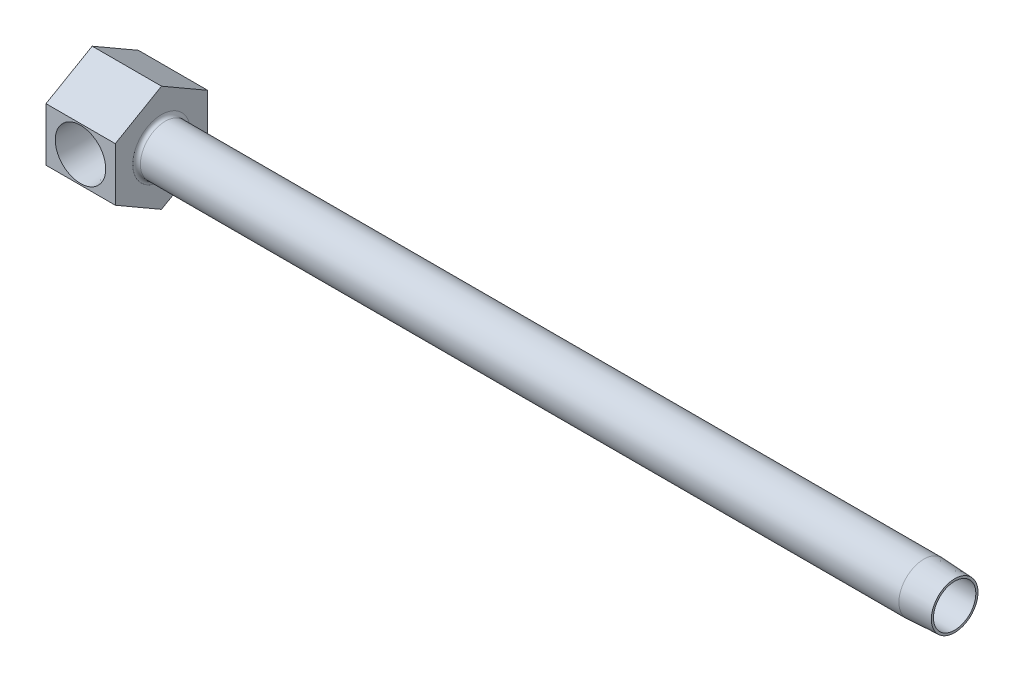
ISO-10303-21;
HEADER;
FILE_DESCRIPTION(('STEP AP214'),'2;1');
FILE_NAME('part.step','',(''),(''),'','','');
FILE_SCHEMA(('AUTOMOTIVE_DESIGN { 1 0 10303 214 1 1 1 1 }'));
ENDSEC;
DATA;
#1=APPLICATION_CONTEXT('core data for automotive mechanical design processes');
#2=APPLICATION_PROTOCOL_DEFINITION('international standard','automotive_design',2000,#1);
#3=PRODUCT_CONTEXT('',#1,'mechanical');
#4=PRODUCT('Part','Part','',(#3));
#5=PRODUCT_RELATED_PRODUCT_CATEGORY('part','',(#4));
#6=PRODUCT_DEFINITION_FORMATION('','',#4);
#7=PRODUCT_DEFINITION_CONTEXT('part definition',#1,'design');
#8=PRODUCT_DEFINITION('design','',#6,#7);
#9=PRODUCT_DEFINITION_SHAPE('','',#8);
#10=(LENGTH_UNIT() NAMED_UNIT(*) SI_UNIT(.MILLI.,.METRE.));
#11=(NAMED_UNIT(*) PLANE_ANGLE_UNIT() SI_UNIT($,.RADIAN.));
#12=(NAMED_UNIT(*) SI_UNIT($,.STERADIAN.) SOLID_ANGLE_UNIT());
#13=UNCERTAINTY_MEASURE_WITH_UNIT(LENGTH_MEASURE(1.E-05),#10,'distance_accuracy_value','');
#14=(GEOMETRIC_REPRESENTATION_CONTEXT(3) GLOBAL_UNCERTAINTY_ASSIGNED_CONTEXT((#13)) GLOBAL_UNIT_ASSIGNED_CONTEXT((#10,
#11,#12)) REPRESENTATION_CONTEXT('',''));
#15=CARTESIAN_POINT('',(0.,0.,0.));
#16=DIRECTION('',(0.,0.,1.));
#17=DIRECTION('',(1.,0.,0.));
#18=AXIS2_PLACEMENT_3D('',#15,#16,#17);
#19=CARTESIAN_POINT('',(7.14375,0.,9.525));
#20=DIRECTION('',(1.,0.,0.));
#21=DIRECTION('',(0.,0.,-1.));
#22=AXIS2_PLACEMENT_3D('',#19,#20,#21);
#23=PLANE('',#22);
#24=DIRECTION('',(0.,0.,1.));
#25=VECTOR('',#24,1.);
#26=CARTESIAN_POINT('',(7.14375,4.21628045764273,19.05));
#27=LINE('',#26,#25);
#28=CARTESIAN_POINT('',(7.14375,4.21628045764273,8.39289543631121));
#29=VERTEX_POINT('',#28);
#30=CARTESIAN_POINT('',(7.14375,4.21628045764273,10.16));
#31=VERTEX_POINT('',#30);
#32=EDGE_CURVE('E280',#29,#31,#27,.T.);
#33=ORIENTED_EDGE('',*,*,#32,.F.);
#34=CARTESIAN_POINT('',(7.14375,0.,9.525));
#35=DIRECTION('',(1.,0.,0.));
#36=DIRECTION('',(0.,0.,-1.));
#37=AXIS2_PLACEMENT_3D('',#34,#35,#36);
#38=CIRCLE('',#37,4.365625);
#39=CARTESIAN_POINT('',(7.14375,4.31919629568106,10.16));
#40=VERTEX_POINT('',#39);
#41=EDGE_CURVE('E163',#29,#40,#38,.T.);
#42=ORIENTED_EDGE('',*,*,#41,.T.);
#43=DIRECTION('',(0.,1.,0.));
#44=VECTOR('',#43,1.);
#45=CARTESIAN_POINT('',(7.14375,0.,10.16));
#46=LINE('',#45,#44);
#47=EDGE_CURVE('E153',#31,#40,#46,.T.);
#48=ORIENTED_EDGE('',*,*,#47,.F.);
#49=EDGE_LOOP('',(#33,#42,#48));
#50=FACE_BOUND('',#49,.T.);
#51=ADVANCED_FACE('F15',(#50),#23,.T.);
#52=CARTESIAN_POINT('',(14.2875,5.4992613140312,19.05));
#53=DIRECTION('',(0.,0.,-1.));
#54=DIRECTION('',(-1.,0.,0.));
#55=AXIS2_PLACEMENT_3D('',#52,#53,#54);
#56=PLANE('',#55);
#57=CARTESIAN_POINT('',(7.112,0.,19.05));
#58=DIRECTION('',(0.,0.,1.));
#59=DIRECTION('',(1.,0.,0.));
#60=AXIS2_PLACEMENT_3D('',#57,#58,#59);
#61=CIRCLE('',#60,5.2023645);
#62=CARTESIAN_POINT('',(12.3143645,0.,19.05));
#63=VERTEX_POINT('',#62);
#64=EDGE_CURVE('E269',#63,#63,#61,.T.);
#65=ORIENTED_EDGE('',*,*,#64,.F.);
#66=EDGE_LOOP('',(#65));
#67=FACE_BOUND('',#66,.T.);
#68=DIRECTION('',(0.,-1.,0.));
#69=VECTOR('',#68,1.);
#70=CARTESIAN_POINT('',(0.,5.4992613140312,19.05));
#71=LINE('',#70,#69);
#72=CARTESIAN_POINT('',(0.,5.4992613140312,19.05));
#73=VERTEX_POINT('',#72);
#74=CARTESIAN_POINT('',(0.,-5.49926131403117,19.05));
#75=VERTEX_POINT('',#74);
#76=EDGE_CURVE('E178',#73,#75,#71,.T.);
#77=ORIENTED_EDGE('',*,*,#76,.T.);
#78=DIRECTION('',(-1.,0.,0.));
#79=VECTOR('',#78,1.);
#80=CARTESIAN_POINT('',(14.2875,-5.49926131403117,19.05));
#81=LINE('',#80,#79);
#82=CARTESIAN_POINT('',(14.2875,-5.49926131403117,19.05));
#83=VERTEX_POINT('',#82);
#84=EDGE_CURVE('E201',#83,#75,#81,.T.);
#85=ORIENTED_EDGE('',*,*,#84,.F.);
#86=DIRECTION('',(0.,-1.,0.));
#87=VECTOR('',#86,1.);
#88=CARTESIAN_POINT('',(14.2875,5.4992613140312,19.05));
#89=LINE('',#88,#87);
#90=CARTESIAN_POINT('',(14.2875,5.4992613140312,19.05));
#91=VERTEX_POINT('',#90);
#92=EDGE_CURVE('E194',#91,#83,#89,.T.);
#93=ORIENTED_EDGE('',*,*,#92,.F.);
#94=DIRECTION('',(-1.,0.,0.));
#95=VECTOR('',#94,1.);
#96=CARTESIAN_POINT('',(14.2875,5.4992613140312,19.05));
#97=LINE('',#96,#95);
#98=EDGE_CURVE('E204',#91,#73,#97,.T.);
#99=ORIENTED_EDGE('',*,*,#98,.T.);
#100=EDGE_LOOP('',(#77,#85,#93,#99));
#101=FACE_BOUND('',#100,.T.);
#102=ADVANCED_FACE('F119',(#67,#101),#56,.F.);
#103=CARTESIAN_POINT('',(14.2875,-5.49926131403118,0.));
#104=DIRECTION('',(1.,0.,0.));
#105=DIRECTION('',(0.,1.,0.));
#106=AXIS2_PLACEMENT_3D('',#103,#104,#105);
#107=PLANE('',#106);
#108=CARTESIAN_POINT('',(14.2875,0.,9.525));
#109=DIRECTION('',(1.,0.,0.));
#110=DIRECTION('',(0.,1.,0.));
#111=AXIS2_PLACEMENT_3D('',#108,#109,#110);
#112=CIRCLE('',#111,5.9309);
#113=CARTESIAN_POINT('',(14.2875,5.9309,9.525));
#114=VERTEX_POINT('',#113);
#115=EDGE_CURVE('E216',#114,#114,#112,.F.);
#116=ORIENTED_EDGE('',*,*,#115,.T.);
#117=EDGE_LOOP('',(#116));
#118=FACE_BOUND('',#117,.T.);
#119=DIRECTION('',(0.,0.5,-0.866025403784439));
#120=VECTOR('',#119,1.);
#121=CARTESIAN_POINT('',(14.2875,-10.9985226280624,9.525));
#122=LINE('',#121,#120);
#123=CARTESIAN_POINT('',(14.2875,-10.9985226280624,9.525));
#124=VERTEX_POINT('',#123);
#125=CARTESIAN_POINT('',(14.2875,-5.49926131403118,0.));
#126=VERTEX_POINT('',#125);
#127=EDGE_CURVE('E184',#124,#126,#122,.T.);
#128=ORIENTED_EDGE('',*,*,#127,.T.);
#129=DIRECTION('',(0.,1.,0.));
#130=VECTOR('',#129,1.);
#131=CARTESIAN_POINT('',(14.2875,-5.49926131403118,0.));
#132=LINE('',#131,#130);
#133=CARTESIAN_POINT('',(14.2875,5.49926131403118,0.));
#134=VERTEX_POINT('',#133);
#135=EDGE_CURVE('E188',#126,#134,#132,.T.);
#136=ORIENTED_EDGE('',*,*,#135,.T.);
#137=DIRECTION('',(0.,0.5,0.866025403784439));
#138=VECTOR('',#137,1.);
#139=CARTESIAN_POINT('',(14.2875,5.49926131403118,0.));
#140=LINE('',#139,#138);
#141=CARTESIAN_POINT('',(14.2875,10.9985226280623,9.525));
#142=VERTEX_POINT('',#141);
#143=EDGE_CURVE('E190',#134,#142,#140,.T.);
#144=ORIENTED_EDGE('',*,*,#143,.T.);
#145=DIRECTION('',(0.,-0.5,0.86602540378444));
#146=VECTOR('',#145,1.);
#147=CARTESIAN_POINT('',(14.2875,10.9985226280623,9.525));
#148=LINE('',#147,#146);
#149=EDGE_CURVE('E192',#142,#91,#148,.T.);
#150=ORIENTED_EDGE('',*,*,#149,.T.);
#151=ORIENTED_EDGE('',*,*,#92,.T.);
#152=DIRECTION('',(0.,-0.5,-0.866025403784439));
#153=VECTOR('',#152,1.);
#154=CARTESIAN_POINT('',(14.2875,-5.49926131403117,19.05));
#155=LINE('',#154,#153);
#156=EDGE_CURVE('E38',#83,#124,#155,.T.);
#157=ORIENTED_EDGE('',*,*,#156,.T.);
#158=EDGE_LOOP('',(#128,#136,#144,#150,#151,#157));
#159=FACE_BOUND('',#158,.T.);
#160=ADVANCED_FACE('F127',(#118,#159),#107,.T.);
#161=CARTESIAN_POINT('',(14.2875,-10.9985226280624,9.525));
#162=DIRECTION('',(0.,0.866025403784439,0.5));
#163=DIRECTION('',(0.,-0.5,0.866025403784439));
#164=AXIS2_PLACEMENT_3D('',#161,#162,#163);
#165=PLANE('',#164);
#166=DIRECTION('',(0.,0.5,-0.866025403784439));
#167=VECTOR('',#166,1.);
#168=CARTESIAN_POINT('',(0.,-10.9985226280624,9.525));
#169=LINE('',#168,#167);
#170=CARTESIAN_POINT('',(0.,-10.9985226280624,9.525));
#171=VERTEX_POINT('',#170);
#172=CARTESIAN_POINT('',(0.,-5.49926131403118,0.));
#173=VERTEX_POINT('',#172);
#174=EDGE_CURVE('E166',#171,#173,#169,.T.);
#175=ORIENTED_EDGE('',*,*,#174,.T.);
#176=DIRECTION('',(-1.,0.,0.));
#177=VECTOR('',#176,1.);
#178=CARTESIAN_POINT('',(14.2875,-5.49926131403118,0.));
#179=LINE('',#178,#177);
#180=EDGE_CURVE('E213',#126,#173,#179,.T.);
#181=ORIENTED_EDGE('',*,*,#180,.F.);
#182=ORIENTED_EDGE('',*,*,#127,.F.);
#183=DIRECTION('',(-1.,0.,0.));
#184=VECTOR('',#183,1.);
#185=CARTESIAN_POINT('',(14.2875,-10.9985226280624,9.525));
#186=LINE('',#185,#184);
#187=EDGE_CURVE('E197',#124,#171,#186,.T.);
#188=ORIENTED_EDGE('',*,*,#187,.T.);
#189=EDGE_LOOP('',(#175,#181,#182,#188));
#190=FACE_BOUND('',#189,.T.);
#191=ADVANCED_FACE('F301',(#190),#165,.F.);
#192=CARTESIAN_POINT('',(14.2875,-5.49926131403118,0.));
#193=DIRECTION('',(0.,0.,1.));
#194=DIRECTION('',(0.,-1.,0.));
#195=AXIS2_PLACEMENT_3D('',#192,#193,#194);
#196=PLANE('',#195);
#197=DIRECTION('',(0.,1.,0.));
#198=VECTOR('',#197,1.);
#199=CARTESIAN_POINT('',(0.,-5.49926131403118,0.));
#200=LINE('',#199,#198);
#201=CARTESIAN_POINT('',(0.,5.49926131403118,0.));
#202=VERTEX_POINT('',#201);
#203=EDGE_CURVE('E169',#173,#202,#200,.T.);
#204=ORIENTED_EDGE('',*,*,#203,.T.);
#205=DIRECTION('',(-1.,0.,0.));
#206=VECTOR('',#205,1.);
#207=CARTESIAN_POINT('',(14.2875,5.49926131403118,0.));
#208=LINE('',#207,#206);
#209=EDGE_CURVE('E210',#134,#202,#208,.T.);
#210=ORIENTED_EDGE('',*,*,#209,.F.);
#211=ORIENTED_EDGE('',*,*,#135,.F.);
#212=ORIENTED_EDGE('',*,*,#180,.T.);
#213=EDGE_LOOP('',(#204,#210,#211,#212));
#214=FACE_BOUND('',#213,.T.);
#215=ADVANCED_FACE('F307',(#214),#196,.F.);
#216=CARTESIAN_POINT('',(14.2875,5.49926131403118,0.));
#217=DIRECTION('',(0.,-0.866025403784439,0.5));
#218=DIRECTION('',(0.,-0.5,-0.866025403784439));
#219=AXIS2_PLACEMENT_3D('',#216,#217,#218);
#220=PLANE('',#219);
#221=DIRECTION('',(0.,0.5,0.866025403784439));
#222=VECTOR('',#221,1.);
#223=CARTESIAN_POINT('',(0.,5.49926131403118,0.));
#224=LINE('',#223,#222);
#225=CARTESIAN_POINT('',(0.,10.9985226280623,9.525));
#226=VERTEX_POINT('',#225);
#227=EDGE_CURVE('E172',#202,#226,#224,.T.);
#228=ORIENTED_EDGE('',*,*,#227,.T.);
#229=DIRECTION('',(-1.,0.,0.));
#230=VECTOR('',#229,1.);
#231=CARTESIAN_POINT('',(14.2875,10.9985226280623,9.525));
#232=LINE('',#231,#230);
#233=EDGE_CURVE('E207',#142,#226,#232,.T.);
#234=ORIENTED_EDGE('',*,*,#233,.F.);
#235=ORIENTED_EDGE('',*,*,#143,.F.);
#236=ORIENTED_EDGE('',*,*,#209,.T.);
#237=EDGE_LOOP('',(#228,#234,#235,#236));
#238=FACE_BOUND('',#237,.T.);
#239=ADVANCED_FACE('F309',(#238),#220,.F.);
#240=CARTESIAN_POINT('',(14.2875,10.9985226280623,9.525));
#241=DIRECTION('',(0.,-0.86602540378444,-0.5));
#242=DIRECTION('',(0.,0.5,-0.86602540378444));
#243=AXIS2_PLACEMENT_3D('',#240,#241,#242);
#244=PLANE('',#243);
#245=DIRECTION('',(0.,-0.5,0.86602540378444));
#246=VECTOR('',#245,1.);
#247=CARTESIAN_POINT('',(0.,10.9985226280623,9.525));
#248=LINE('',#247,#246);
#249=EDGE_CURVE('E175',#226,#73,#248,.T.);
#250=ORIENTED_EDGE('',*,*,#249,.T.);
#251=ORIENTED_EDGE('',*,*,#98,.F.);
#252=ORIENTED_EDGE('',*,*,#149,.F.);
#253=ORIENTED_EDGE('',*,*,#233,.T.);
#254=EDGE_LOOP('',(#250,#251,#252,#253));
#255=FACE_BOUND('',#254,.T.);
#256=ADVANCED_FACE('F312',(#255),#244,.F.);
#257=CARTESIAN_POINT('',(14.2875,-5.49926131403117,19.05));
#258=DIRECTION('',(0.,0.866025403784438,-0.5));
#259=DIRECTION('',(0.,0.5,0.866025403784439));
#260=AXIS2_PLACEMENT_3D('',#257,#258,#259);
#261=PLANE('',#260);
#262=DIRECTION('',(0.,-0.5,-0.866025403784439));
#263=VECTOR('',#262,1.);
#264=CARTESIAN_POINT('',(0.,-5.49926131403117,19.05));
#265=LINE('',#264,#263);
#266=EDGE_CURVE('E181',#75,#171,#265,.T.);
#267=ORIENTED_EDGE('',*,*,#266,.T.);
#268=ORIENTED_EDGE('',*,*,#187,.F.);
#269=ORIENTED_EDGE('',*,*,#156,.F.);
#270=ORIENTED_EDGE('',*,*,#84,.T.);
#271=EDGE_LOOP('',(#267,#268,#269,#270));
#272=FACE_BOUND('',#271,.T.);
#273=ADVANCED_FACE('F296',(#272),#261,.F.);
#274=CARTESIAN_POINT('',(0.,-5.49926131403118,0.));
#275=DIRECTION('',(1.,0.,0.));
#276=DIRECTION('',(0.,1.,0.));
#277=AXIS2_PLACEMENT_3D('',#274,#275,#276);
#278=PLANE('',#277);
#279=ORIENTED_EDGE('',*,*,#174,.F.);
#280=ORIENTED_EDGE('',*,*,#266,.F.);
#281=ORIENTED_EDGE('',*,*,#76,.F.);
#282=ORIENTED_EDGE('',*,*,#249,.F.);
#283=ORIENTED_EDGE('',*,*,#227,.F.);
#284=ORIENTED_EDGE('',*,*,#203,.F.);
#285=EDGE_LOOP('',(#279,#280,#281,#282,#283,#284));
#286=FACE_BOUND('',#285,.T.);
#287=ADVANCED_FACE('F141',(#286),#278,.F.);
#288=CARTESIAN_POINT('',(68.0114010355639,0.,9.525));
#289=DIRECTION('',(-1.,0.,0.));
#290=DIRECTION('',(0.,0.,1.));
#291=AXIS2_PLACEMENT_3D('',#288,#289,#290);
#292=CYLINDRICAL_SURFACE('',#291,5.1435);
#293=CARTESIAN_POINT('',(171.45,0.,9.525));
#294=DIRECTION('',(-1.,0.,0.));
#295=DIRECTION('',(0.,0.,1.));
#296=AXIS2_PLACEMENT_3D('',#293,#294,#295);
#297=CIRCLE('',#296,5.1435);
#298=CARTESIAN_POINT('',(171.45,0.,14.6685));
#299=VERTEX_POINT('',#298);
#300=EDGE_CURVE('E10',#299,#299,#297,.F.);
#301=ORIENTED_EDGE('',*,*,#300,.F.);
#302=EDGE_LOOP('',(#301));
#303=FACE_BOUND('',#302,.T.);
#304=CARTESIAN_POINT('',(15.0749,0.,9.525));
#305=DIRECTION('',(1.,0.,0.));
#306=DIRECTION('',(0.,1.,0.));
#307=AXIS2_PLACEMENT_3D('',#304,#305,#306);
#308=CIRCLE('',#307,5.1435);
#309=CARTESIAN_POINT('',(15.0749,5.1435,9.525));
#310=VERTEX_POINT('',#309);
#311=EDGE_CURVE('E219',#310,#310,#308,.T.);
#312=ORIENTED_EDGE('',*,*,#311,.T.);
#313=EDGE_LOOP('',(#312));
#314=FACE_BOUND('',#313,.T.);
#315=ADVANCED_FACE('F17',(#303,#314),#292,.T.);
#316=CARTESIAN_POINT('',(7.14375,-4.31919629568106,10.16));
#317=VERTEX_POINT('',#316);
#318=CARTESIAN_POINT('',(7.14375,-4.21628045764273,10.16));
#319=VERTEX_POINT('',#318);
#320=EDGE_CURVE('E146',#317,#319,#46,.T.);
#321=ORIENTED_EDGE('',*,*,#320,.F.);
#322=CARTESIAN_POINT('',(7.14375,-4.21628045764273,8.39289543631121));
#323=VERTEX_POINT('',#322);
#324=EDGE_CURVE('E148',#317,#323,#38,.T.);
#325=ORIENTED_EDGE('',*,*,#324,.T.);
#326=DIRECTION('',(0.,0.,1.));
#327=VECTOR('',#326,1.);
#328=CARTESIAN_POINT('',(7.14375,-4.21628045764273,19.05));
#329=LINE('',#328,#327);
#330=EDGE_CURVE('E149',#319,#323,#329,.F.);
#331=ORIENTED_EDGE('',*,*,#330,.F.);
#332=EDGE_LOOP('',(#321,#325,#331));
#333=FACE_BOUND('',#332,.T.);
#334=ADVANCED_FACE('F122',(#333),#23,.T.);
#335=CARTESIAN_POINT('',(66.1375087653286,0.,9.525));
#336=DIRECTION('',(1.,0.,0.));
#337=DIRECTION('',(0.,0.,-1.));
#338=AXIS2_PLACEMENT_3D('',#335,#336,#337);
#339=CYLINDRICAL_SURFACE('',#338,4.365625);
#340=DIRECTION('',(1.,0.,0.));
#341=VECTOR('',#340,1.);
#342=CARTESIAN_POINT('',(66.1375087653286,4.31919629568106,10.16));
#343=LINE('',#342,#341);
#344=CARTESIAN_POINT('',(9.50166012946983,4.31919629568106,10.16));
#345=VERTEX_POINT('',#344);
#346=EDGE_CURVE('E23',#40,#345,#343,.T.);
#347=ORIENTED_EDGE('',*,*,#346,.F.);
#348=ORIENTED_EDGE('',*,*,#41,.F.);
#349=CARTESIAN_POINT('',(11.0152606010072,1.5945487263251,5.461));
#350=CARTESIAN_POINT('',(10.9690910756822,1.7075595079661,5.50534166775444));
#351=CARTESIAN_POINT('',(10.9186455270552,1.81703423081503,5.55373339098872));
#352=CARTESIAN_POINT('',(10.810302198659,2.02846645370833,5.65746242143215));
#353=CARTESIAN_POINT('',(10.7524192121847,2.13043826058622,5.71278593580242));
#354=CARTESIAN_POINT('',(10.5698905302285,2.42358040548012,5.88682744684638));
#355=CARTESIAN_POINT('',(10.4356317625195,2.6037024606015,6.01432367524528));
#356=CARTESIAN_POINT('',(10.2004726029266,2.87382153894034,6.2358690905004));
#357=CARTESIAN_POINT('',(10.1051285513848,2.97281573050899,6.32528321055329));
#358=CARTESIAN_POINT('',(9.90783434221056,3.15907014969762,6.50903483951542));
#359=CARTESIAN_POINT('',(9.80588273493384,3.2463277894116,6.60337342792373));
#360=CARTESIAN_POINT('',(9.59613587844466,3.40951469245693,6.79556583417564));
#361=CARTESIAN_POINT('',(9.48833347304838,3.48542963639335,6.89342390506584));
#362=CARTESIAN_POINT('',(9.26745878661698,3.62617881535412,7.09103053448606));
#363=CARTESIAN_POINT('',(9.15438825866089,3.69101670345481,7.19077845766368));
#364=CARTESIAN_POINT('',(8.91700112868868,3.81296593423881,7.39547820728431));
#365=CARTESIAN_POINT('',(8.79240497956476,3.86952009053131,7.50043788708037));
#366=CARTESIAN_POINT('',(8.53587575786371,3.97111492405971,7.70779573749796));
#367=CARTESIAN_POINT('',(8.40392330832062,4.01612325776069,7.81018600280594));
#368=CARTESIAN_POINT('',(8.16304729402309,4.0847277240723,7.98226690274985));
#369=CARTESIAN_POINT('',(8.0562781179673,4.11086974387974,8.05387458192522));
#370=CARTESIAN_POINT('',(7.89027521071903,4.14432560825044,8.15224503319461));
#371=CARTESIAN_POINT('',(7.83425575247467,4.15448196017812,8.18339689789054));
#372=CARTESIAN_POINT('',(7.71975817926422,4.17277321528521,8.24142733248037));
#373=CARTESIAN_POINT('',(7.6612817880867,4.18090950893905,8.26830883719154));
#374=CARTESIAN_POINT('',(7.52931857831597,4.19631734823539,8.32062856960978));
#375=CARTESIAN_POINT('',(7.45518069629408,4.2030846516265,8.34468558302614));
#376=CARTESIAN_POINT('',(7.30234246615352,4.21282137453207,8.37996487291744));
#377=CARTESIAN_POINT('',(7.22358315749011,4.21571837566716,8.39094201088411));
#378=CARTESIAN_POINT('',(7.14374999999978,4.21628045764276,8.39289543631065));
#379=B_SPLINE_CURVE_WITH_KNOTS('',3,(#349,#350,#351,#352,#353,#354,#355,#356,#357,#358,#359,
#360,#361,#362,#363,#364,#365,#366,#367,#368,#369,#370,#371,#372,#373,#374,#375,#376,#377,#378),
.UNSPECIFIED.,.F.,.F.,(4,2,2,2,2,2,2,2,2,2,2,2,2,2,4),(0.,0.389178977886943,0.777595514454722,
1.54850925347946,2.03989074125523,2.5313804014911,3.02348538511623,3.51542776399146,
4.03226982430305,4.5505442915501,4.94339994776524,5.13792303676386,5.33231185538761,
5.56585330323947,5.80370611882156),.UNSPECIFIED.);
#380=CARTESIAN_POINT('',(11.0152606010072,1.5945487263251,5.461));
#381=VERTEX_POINT('',#380);
#382=EDGE_CURVE('E222',#381,#29,#379,.T.);
#383=ORIENTED_EDGE('',*,*,#382,.F.);
#384=CARTESIAN_POINT('',(11.038608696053,-1.66986531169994,5.4913625));
#385=CARTESIAN_POINT('',(11.0105354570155,-1.5831922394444,5.45544731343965));
#386=CARTESIAN_POINT('',(10.985979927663,-1.49442111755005,5.422003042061));
#387=CARTESIAN_POINT('',(10.9431209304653,-1.31365154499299,5.36062405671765));
#388=CARTESIAN_POINT('',(10.9248095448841,-1.22165734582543,5.3326823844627));
#389=CARTESIAN_POINT('',(10.8936059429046,-1.03529168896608,5.28281066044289));
#390=CARTESIAN_POINT('',(10.8807075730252,-0.94092306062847,5.26087379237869));
#391=CARTESIAN_POINT('',(10.8594086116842,-0.750424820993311,5.22325970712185));
#392=CARTESIAN_POINT('',(10.8510094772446,-0.654294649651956,5.20758451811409));
#393=CARTESIAN_POINT('',(10.8381415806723,-0.463156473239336,5.18296779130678));
#394=CARTESIAN_POINT('',(10.8335877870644,-0.368172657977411,5.1738812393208));
#395=CARTESIAN_POINT('',(10.8276558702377,-0.177678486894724,5.16194794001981));
#396=CARTESIAN_POINT('',(10.8262790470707,-0.0821679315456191,5.15910374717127));
#397=CARTESIAN_POINT('',(10.826564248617,0.108822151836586,5.15968693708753));
#398=CARTESIAN_POINT('',(10.828226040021,0.204301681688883,5.16311383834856));
#399=CARTESIAN_POINT('',(10.8347557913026,0.3946850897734,5.17620642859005));
#400=CARTESIAN_POINT('',(10.8396224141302,0.489589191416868,5.18586951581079));
#401=CARTESIAN_POINT('',(10.8530224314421,0.678329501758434,5.2113452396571));
#402=CARTESIAN_POINT('',(10.861556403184,0.772165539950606,5.22715884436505));
#403=CARTESIAN_POINT('',(10.882977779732,0.958108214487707,5.26475262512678));
#404=CARTESIAN_POINT('',(10.8958637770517,1.05021539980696,5.28653087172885));
#405=CARTESIAN_POINT('',(10.9268394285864,1.23213175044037,5.33579934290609));
#406=CARTESIAN_POINT('',(10.9449350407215,1.32193815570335,5.36329609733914));
#407=CARTESIAN_POINT('',(10.9870994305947,1.49845562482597,5.42352620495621));
#408=CARTESIAN_POINT('',(11.0111754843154,1.58516276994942,5.45626591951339));
#409=CARTESIAN_POINT('',(11.038608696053,1.66986531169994,5.4913625));
#410=B_SPLINE_CURVE_WITH_KNOTS('',3,(#384,#385,#386,#387,#388,#389,#390,#391,#392,#393,#394,
#395,#396,#397,#398,#399,#400,#401,#402,#403,#404,#405,#406,#407,#408,#409),.UNSPECIFIED.,.F.,
.F.,(4,2,2,2,2,2,2,2,2,2,2,2,4),(0.,0.293591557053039,0.586809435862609,0.879693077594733,
1.17267150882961,1.45898777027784,1.74542117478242,2.03183258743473,2.31812458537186,
2.60446166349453,2.89070622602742,3.17727945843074,3.46420306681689),.UNSPECIFIED.);
#411=CARTESIAN_POINT('',(11.0152606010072,-1.5945487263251,5.461));
#412=VERTEX_POINT('',#411);
#413=EDGE_CURVE('E227',#412,#381,#410,.T.);
#414=ORIENTED_EDGE('',*,*,#413,.F.);
#415=CARTESIAN_POINT('',(7.14375,-4.21628045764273,8.39289543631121));
#416=CARTESIAN_POINT('',(7.18362399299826,-4.21598583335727,8.39181806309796));
#417=CARTESIAN_POINT('',(7.22338201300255,-4.21511517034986,8.38855660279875));
#418=CARTESIAN_POINT('',(7.30220974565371,-4.21229002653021,8.3781194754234));
#419=CARTESIAN_POINT('',(7.34128135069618,-4.21033927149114,8.37095726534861));
#420=CARTESIAN_POINT('',(7.45558593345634,-4.20306181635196,8.34463096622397));
#421=CARTESIAN_POINT('',(7.52959005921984,-4.19629141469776,8.32054287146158));
#422=CARTESIAN_POINT('',(7.67793141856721,-4.17895935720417,8.2616842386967));
#423=CARTESIAN_POINT('',(7.75200183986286,-4.16818767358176,8.22634138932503));
#424=CARTESIAN_POINT('',(7.89635080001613,-4.14345087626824,8.14945009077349));
#425=CARTESIAN_POINT('',(7.96662283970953,-4.12948049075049,8.10789143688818));
#426=CARTESIAN_POINT('',(8.10525974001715,-4.09836535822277,8.02024615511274));
#427=CARTESIAN_POINT('',(8.17357097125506,-4.08117012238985,7.97409391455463));
#428=CARTESIAN_POINT('',(8.30769836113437,-4.04390532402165,7.87936489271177));
#429=CARTESIAN_POINT('',(8.37351346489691,-4.02383456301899,7.83078710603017));
#430=CARTESIAN_POINT('',(8.57859672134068,-3.95588469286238,7.67482924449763));
#431=CARTESIAN_POINT('',(8.71418056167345,-3.90283307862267,7.56482866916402));
#432=CARTESIAN_POINT('',(8.97841531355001,-3.78358080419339,7.34346052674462));
#433=CARTESIAN_POINT('',(9.10705932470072,-3.71736735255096,7.23209172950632));
#434=CARTESIAN_POINT('',(9.35705912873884,-3.57190642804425,7.01153592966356));
#435=CARTESIAN_POINT('',(9.47845600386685,-3.49274436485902,6.90233956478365));
#436=CARTESIAN_POINT('',(9.71438396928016,-3.32067953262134,6.68762551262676));
#437=CARTESIAN_POINT('',(9.82891987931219,-3.22778657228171,6.58210526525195));
#438=CARTESIAN_POINT('',(10.0969445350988,-2.98549279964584,6.33327532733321));
#439=CARTESIAN_POINT('',(10.2465325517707,-2.82876640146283,6.19275827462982));
#440=CARTESIAN_POINT('',(10.5251240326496,-2.48539491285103,5.92944140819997));
#441=CARTESIAN_POINT('',(10.6541872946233,-2.29884003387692,5.80659022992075));
#442=CARTESIAN_POINT('',(10.815064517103,-2.01834728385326,5.65289947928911));
#443=CARTESIAN_POINT('',(10.8584525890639,-1.93670806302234,5.61137999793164));
#444=CARTESIAN_POINT('',(10.9405236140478,-1.76894321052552,5.53274400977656));
#445=CARTESIAN_POINT('',(10.9792015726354,-1.6828129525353,5.49563217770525));
#446=CARTESIAN_POINT('',(11.0152606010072,-1.5945487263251,5.461));
#447=B_SPLINE_CURVE_WITH_KNOTS('',3,(#415,#416,#417,#418,#419,#420,#421,#422,#423,#424,#425,
#426,#427,#428,#429,#430,#431,#432,#433,#434,#435,#436,#437,#438,#439,#440,#441,#442,#443,#444,
#445,#446),.UNSPECIFIED.,.F.,.F.,(4,2,2,2,2,2,2,2,2,2,2,2,2,2,2,4),(0.,0.119524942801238,
0.238640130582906,0.471907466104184,0.719716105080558,0.967936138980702,1.2204276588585,
1.47302472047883,2.01967972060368,2.56686861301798,3.1105838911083,3.65391262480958,
4.4259772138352,5.19574951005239,5.49953103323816,5.80363192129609),.UNSPECIFIED.);
#448=EDGE_CURVE('E162',#323,#412,#447,.T.);
#449=ORIENTED_EDGE('',*,*,#448,.F.);
#450=ORIENTED_EDGE('',*,*,#324,.F.);
#451=DIRECTION('',(1.,0.,0.));
#452=VECTOR('',#451,1.);
#453=CARTESIAN_POINT('',(66.1375087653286,-4.31919629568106,10.16));
#454=LINE('',#453,#452);
#455=CARTESIAN_POINT('',(9.50166012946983,-4.31919629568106,10.16));
#456=VERTEX_POINT('',#455);
#457=EDGE_CURVE('E160',#456,#317,#454,.F.);
#458=ORIENTED_EDGE('',*,*,#457,.F.);
#459=CARTESIAN_POINT('',(9.50159462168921,4.31922569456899,10.1598));
#460=CARTESIAN_POINT('',(9.52205476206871,4.31004461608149,10.2222542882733));
#461=CARTESIAN_POINT('',(9.54440879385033,4.29961032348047,10.2838517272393));
#462=CARTESIAN_POINT('',(9.592244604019,4.27639816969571,10.4052958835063));
#463=CARTESIAN_POINT('',(9.61772301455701,4.26362282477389,10.4651444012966));
#464=CARTESIAN_POINT('',(9.6977084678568,4.22211002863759,10.641720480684));
#465=CARTESIAN_POINT('',(9.75594525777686,4.19010742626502,10.7559937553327));
#466=CARTESIAN_POINT('',(9.87844694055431,4.11827910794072,10.9783012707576));
#467=CARTESIAN_POINT('',(9.94270165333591,4.07846648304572,11.0863455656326));
#468=CARTESIAN_POINT('',(10.0748723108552,3.9913538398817,11.2972300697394));
#469=CARTESIAN_POINT('',(10.1427929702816,3.94404402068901,11.4000632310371));
#470=CARTESIAN_POINT('',(10.298774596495,3.82856370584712,11.6276502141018));
#471=CARTESIAN_POINT('',(10.3873705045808,3.75819622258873,11.7509249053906));
#472=CARTESIAN_POINT('',(10.5646676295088,3.60591330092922,11.9899830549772));
#473=CARTESIAN_POINT('',(10.6533688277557,3.52399966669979,12.1057676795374));
#474=CARTESIAN_POINT('',(10.828903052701,3.34837324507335,12.3298815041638));
#475=CARTESIAN_POINT('',(10.9157338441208,3.25464716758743,12.4382020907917));
#476=CARTESIAN_POINT('',(11.0854790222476,3.05533823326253,12.6465978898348));
#477=CARTESIAN_POINT('',(11.1683947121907,2.94975936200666,12.746675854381));
#478=CARTESIAN_POINT('',(11.3637298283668,2.67738871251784,12.9797077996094));
#479=CARTESIAN_POINT('',(11.4730979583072,2.50408908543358,13.1077769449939));
#480=CARTESIAN_POINT('',(11.6736784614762,2.13317678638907,13.3402290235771));
#481=CARTESIAN_POINT('',(11.764930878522,1.93561933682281,13.444664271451));
#482=CARTESIAN_POINT('',(11.9092563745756,1.55445058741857,13.608817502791));
#483=CARTESIAN_POINT('',(11.9662034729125,1.37434002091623,13.6731460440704));
#484=CARTESIAN_POINT('',(12.036275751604,1.09545803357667,13.7520594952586));
#485=CARTESIAN_POINT('',(12.0570798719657,1.00100886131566,13.7754393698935));
#486=CARTESIAN_POINT('',(12.093196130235,0.80976989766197,13.8159777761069));
#487=CARTESIAN_POINT('',(12.1085105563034,0.712981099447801,13.8331388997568));
#488=CARTESIAN_POINT('',(12.1334016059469,0.517219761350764,13.861011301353));
#489=CARTESIAN_POINT('',(12.1429475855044,0.418238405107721,13.8716881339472));
#490=CARTESIAN_POINT('',(12.1559671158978,0.219418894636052,13.8862461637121));
#491=CARTESIAN_POINT('',(12.159443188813,0.119581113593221,13.8901301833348));
#492=CARTESIAN_POINT('',(12.1602489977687,-0.0801622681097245,13.8910308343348));
#493=CARTESIAN_POINT('',(12.157578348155,-0.180067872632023,13.8880470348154));
#494=CARTESIAN_POINT('',(12.1461610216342,-0.379063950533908,13.87528173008));
#495=CARTESIAN_POINT('',(12.1374146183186,-0.478154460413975,13.8655005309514));
#496=CARTESIAN_POINT('',(12.1041501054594,-0.757548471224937,13.8282625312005));
#497=CARTESIAN_POINT('',(12.0725539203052,-0.936048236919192,13.7928583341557));
#498=CARTESIAN_POINT('',(11.9914510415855,-1.28332325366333,13.701614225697));
#499=CARTESIAN_POINT('',(11.9419389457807,-1.45209555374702,13.645768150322));
#500=CARTESIAN_POINT('',(11.8234161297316,-1.78986703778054,13.5113020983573));
#501=CARTESIAN_POINT('',(11.7531886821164,-1.95786359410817,13.4312490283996));
#502=CARTESIAN_POINT('',(11.5990616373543,-2.2774775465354,13.2539727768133));
#503=CARTESIAN_POINT('',(11.515160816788,-2.42909347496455,13.1567480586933));
#504=CARTESIAN_POINT('',(11.2893838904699,-2.79222476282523,12.8919364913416));
#505=CARTESIAN_POINT('',(11.1405152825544,-2.99235864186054,12.7145443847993));
#506=CARTESIAN_POINT('',(10.9077049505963,-3.26312100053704,12.4281267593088));
#507=CARTESIAN_POINT('',(10.8282461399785,-3.34869576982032,12.3289140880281));
#508=CARTESIAN_POINT('',(10.6676325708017,-3.51003537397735,12.1240974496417));
#509=CARTESIAN_POINT('',(10.5864785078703,-3.58580414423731,12.0184960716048));
#510=CARTESIAN_POINT('',(10.4220303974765,-3.72941202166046,11.798300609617));
#511=CARTESIAN_POINT('',(10.338734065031,-3.79700254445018,11.6835467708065));
#512=CARTESIAN_POINT('',(10.1740816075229,-3.92201333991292,11.4470806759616));
#513=CARTESIAN_POINT('',(10.092727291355,-3.97942442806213,11.3253622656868));
#514=CARTESIAN_POINT('',(9.93568225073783,-4.08324264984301,11.0754774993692));
#515=CARTESIAN_POINT('',(9.85994825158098,-4.12974154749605,10.9473767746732));
#516=CARTESIAN_POINT('',(9.71779756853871,-4.21155620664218,10.6828322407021));
#517=CARTESIAN_POINT('',(9.65135922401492,-4.24689821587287,10.5464089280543));
#518=CARTESIAN_POINT('',(9.57628126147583,-4.28419371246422,10.3652627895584));
#519=CARTESIAN_POINT('',(9.56028735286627,-4.29194911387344,10.3247361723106));
#520=CARTESIAN_POINT('',(9.52977406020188,-4.30640007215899,10.2428664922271));
#521=CARTESIAN_POINT('',(9.51525722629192,-4.31309380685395,10.2015221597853));
#522=CARTESIAN_POINT('',(9.50159462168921,-4.31922569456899,10.1598));
#523=B_SPLINE_CURVE_WITH_KNOTS('',3,(#459,#460,#461,#462,#463,#464,#465,#466,#467,#468,#469,
#470,#471,#472,#473,#474,#475,#476,#477,#478,#479,#480,#481,#482,#483,#484,#485,#486,#487,#488,
#489,#490,#491,#492,#493,#494,#495,#496,#497,#498,#499,#500,#501,#502,#503,#504,#505,#506,#507,
#508,#509,#510,#511,#512,#513,#514,#515,#516,#517,#518,#519,#520,#521,#522),.UNSPECIFIED.,.F.,
.F.,(4,2,2,2,2,2,2,2,2,2,2,2,2,2,2,2,2,2,2,2,2,2,2,2,2,2,2,2,2,2,2,4),(0.,0.19895577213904,
0.397698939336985,0.793542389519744,1.1887279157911,1.58443438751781,2.08580736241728,
2.58710208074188,3.08896592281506,3.5906615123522,4.3128774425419,5.03347872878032,
5.62940645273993,5.92758657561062,6.22564226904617,6.52526772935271,6.82476866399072,
7.12428839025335,7.4237946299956,7.97525228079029,8.52687635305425,9.12138980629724,
9.71595648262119,10.6287987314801,11.0881817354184,11.5473798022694,12.018174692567,
12.4893922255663,12.9564924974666,13.4224855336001,13.5552077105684,13.6881552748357),.UNSPECIFIED.);
#524=EDGE_CURVE('E241',#345,#456,#523,.T.);
#525=ORIENTED_EDGE('',*,*,#524,.F.);
#526=EDGE_LOOP('',(#347,#348,#383,#414,#449,#450,#458,#525));
#527=FACE_BOUND('',#526,.T.);
#528=CARTESIAN_POINT('',(177.8,0.,9.525));
#529=DIRECTION('',(1.,0.,0.));
#530=DIRECTION('',(0.,0.,-1.));
#531=AXIS2_PLACEMENT_3D('',#528,#529,#530);
#532=CIRCLE('',#531,4.365625);
#533=CARTESIAN_POINT('',(177.8,0.,5.159375));
#534=VERTEX_POINT('',#533);
#535=EDGE_CURVE('E267',#534,#534,#532,.T.);
#536=ORIENTED_EDGE('',*,*,#535,.T.);
#537=EDGE_LOOP('',(#536));
#538=FACE_BOUND('',#537,.T.);
#539=ADVANCED_FACE('F114',(#527,#538),#339,.F.);
#540=CARTESIAN_POINT('',(15.0749,0.,9.525));
#541=DIRECTION('',(1.,0.,0.));
#542=DIRECTION('',(0.,1.,0.));
#543=AXIS2_PLACEMENT_3D('',#540,#541,#542);
#544=TOROIDAL_SURFACE('',#543,5.9309,0.7874);
#545=ORIENTED_EDGE('',*,*,#311,.F.);
#546=EDGE_LOOP('',(#545));
#547=FACE_BOUND('',#546,.T.);
#548=ORIENTED_EDGE('',*,*,#115,.F.);
#549=EDGE_LOOP('',(#548));
#550=FACE_BOUND('',#549,.T.);
#551=ADVANCED_FACE('F103',(#547,#550),#544,.F.);
#552=CARTESIAN_POINT('',(7.112,0.,5.461));
#553=DIRECTION('',(0.,0.,1.));
#554=DIRECTION('',(1.,0.,0.));
#555=AXIS2_PLACEMENT_3D('',#552,#553,#554);
#556=CONICAL_SURFACE('',#555,4.2164,1.02974425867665);
#557=ORIENTED_EDGE('',*,*,#413,.T.);
#558=CARTESIAN_POINT('',(7.112,0.,5.461));
#559=DIRECTION('',(0.,0.,1.));
#560=DIRECTION('',(1.,0.,0.));
#561=AXIS2_PLACEMENT_3D('',#558,#559,#560);
#562=CIRCLE('',#561,4.2164);
#563=EDGE_CURVE('E30',#381,#412,#562,.T.);
#564=ORIENTED_EDGE('',*,*,#563,.T.);
#565=EDGE_LOOP('',(#557,#564));
#566=FACE_BOUND('',#565,.T.);
#567=CARTESIAN_POINT('',(7.112,0.,2.92753128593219));
#568=VERTEX_POINT('',#567);
#569=VERTEX_LOOP('',#568);
#570=FACE_BOUND('',#569,.T.);
#571=ADVANCED_FACE('F100',(#566,#570),#556,.F.);
#572=CARTESIAN_POINT('',(7.112,0.,19.05));
#573=DIRECTION('',(0.,0.,1.));
#574=DIRECTION('',(1.,0.,0.));
#575=AXIS2_PLACEMENT_3D('',#572,#573,#574);
#576=CYLINDRICAL_SURFACE('',#575,4.2164);
#577=ORIENTED_EDGE('',*,*,#330,.T.);
#578=ORIENTED_EDGE('',*,*,#448,.T.);
#579=ORIENTED_EDGE('',*,*,#563,.F.);
#580=ORIENTED_EDGE('',*,*,#382,.T.);
#581=ORIENTED_EDGE('',*,*,#32,.T.);
#582=CARTESIAN_POINT('',(7.112,0.,10.16));
#583=DIRECTION('',(0.,0.,1.));
#584=DIRECTION('',(1.,0.,0.));
#585=AXIS2_PLACEMENT_3D('',#582,#583,#584);
#586=CIRCLE('',#585,4.2164);
#587=EDGE_CURVE('E277',#31,#319,#586,.T.);
#588=ORIENTED_EDGE('',*,*,#587,.T.);
#589=EDGE_LOOP('',(#577,#578,#579,#580,#581,#588));
#590=FACE_BOUND('',#589,.T.);
#591=ADVANCED_FACE('F102',(#590),#576,.F.);
#592=CARTESIAN_POINT('',(11.3284,0.,10.16));
#593=DIRECTION('',(0.,0.,-1.));
#594=DIRECTION('',(-1.,0.,0.));
#595=AXIS2_PLACEMENT_3D('',#592,#593,#594);
#596=PLANE('',#595);
#597=ORIENTED_EDGE('',*,*,#47,.T.);
#598=ORIENTED_EDGE('',*,*,#346,.T.);
#599=CARTESIAN_POINT('',(7.112,0.,10.16));
#600=DIRECTION('',(0.,0.,1.));
#601=DIRECTION('',(1.,0.,0.));
#602=AXIS2_PLACEMENT_3D('',#599,#600,#601);
#603=CIRCLE('',#602,4.93618599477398);
#604=EDGE_CURVE('E274',#345,#456,#603,.T.);
#605=ORIENTED_EDGE('',*,*,#604,.T.);
#606=ORIENTED_EDGE('',*,*,#457,.T.);
#607=ORIENTED_EDGE('',*,*,#320,.T.);
#608=ORIENTED_EDGE('',*,*,#587,.F.);
#609=EDGE_LOOP('',(#597,#598,#605,#606,#607,#608));
#610=FACE_BOUND('',#609,.T.);
#611=ADVANCED_FACE('F112',(#610),#596,.F.);
#612=CARTESIAN_POINT('',(7.112,0.,19.05));
#613=DIRECTION('',(0.,0.,1.));
#614=DIRECTION('',(1.,0.,0.));
#615=AXIS2_PLACEMENT_3D('',#612,#613,#614);
#616=CONICAL_SURFACE('',#615,5.2023645,0.0299323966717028);
#617=ORIENTED_EDGE('',*,*,#524,.T.);
#618=ORIENTED_EDGE('',*,*,#604,.F.);
#619=EDGE_LOOP('',(#617,#618));
#620=FACE_BOUND('',#619,.T.);
#621=ORIENTED_EDGE('',*,*,#64,.T.);
#622=EDGE_LOOP('',(#621));
#623=FACE_BOUND('',#622,.T.);
#624=ADVANCED_FACE('F246',(#620,#623),#616,.F.);
#625=CARTESIAN_POINT('',(177.8,0.,9.525));
#626=DIRECTION('',(-1.,0.,0.));
#627=DIRECTION('',(0.,0.,1.));
#628=AXIS2_PLACEMENT_3D('',#625,#626,#627);
#629=CONICAL_SURFACE('',#628,4.81071060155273,0.052359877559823);
#630=ORIENTED_EDGE('',*,*,#300,.T.);
#631=EDGE_LOOP('',(#630));
#632=FACE_BOUND('',#631,.T.);
#633=CARTESIAN_POINT('',(177.8,0.,9.525));
#634=DIRECTION('',(1.,0.,0.));
#635=DIRECTION('',(0.,0.,-1.));
#636=AXIS2_PLACEMENT_3D('',#633,#634,#635);
#637=CIRCLE('',#636,4.81071060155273);
#638=CARTESIAN_POINT('',(177.8,0.,4.71428939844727));
#639=VERTEX_POINT('',#638);
#640=EDGE_CURVE('E264',#639,#639,#637,.T.);
#641=ORIENTED_EDGE('',*,*,#640,.F.);
#642=EDGE_LOOP('',(#641));
#643=FACE_BOUND('',#642,.T.);
#644=ADVANCED_FACE('F250',(#632,#643),#629,.T.);
#645=CARTESIAN_POINT('',(177.8,0.,5.159375));
#646=DIRECTION('',(1.,0.,0.));
#647=DIRECTION('',(0.,0.,-1.));
#648=AXIS2_PLACEMENT_3D('',#645,#646,#647);
#649=PLANE('',#648);
#650=ORIENTED_EDGE('',*,*,#640,.T.);
#651=EDGE_LOOP('',(#650));
#652=FACE_BOUND('',#651,.T.);
#653=ORIENTED_EDGE('',*,*,#535,.F.);
#654=EDGE_LOOP('',(#653));
#655=FACE_BOUND('',#654,.T.);
#656=ADVANCED_FACE('F254',(#652,#655),#649,.T.);
#657=CLOSED_SHELL('',(#51,#102,#160,#191,#215,#239,#256,#273,#287,#315,#334,#539,#551,#571,#591,
#611,#624,#644,#656));
#658=MANIFOLD_SOLID_BREP('B1',#657);
#659=ADVANCED_BREP_SHAPE_REPRESENTATION('',(#18,#658),#14);
#660=SHAPE_DEFINITION_REPRESENTATION(#9,#659);
ENDSEC;
END-ISO-10303-21;
